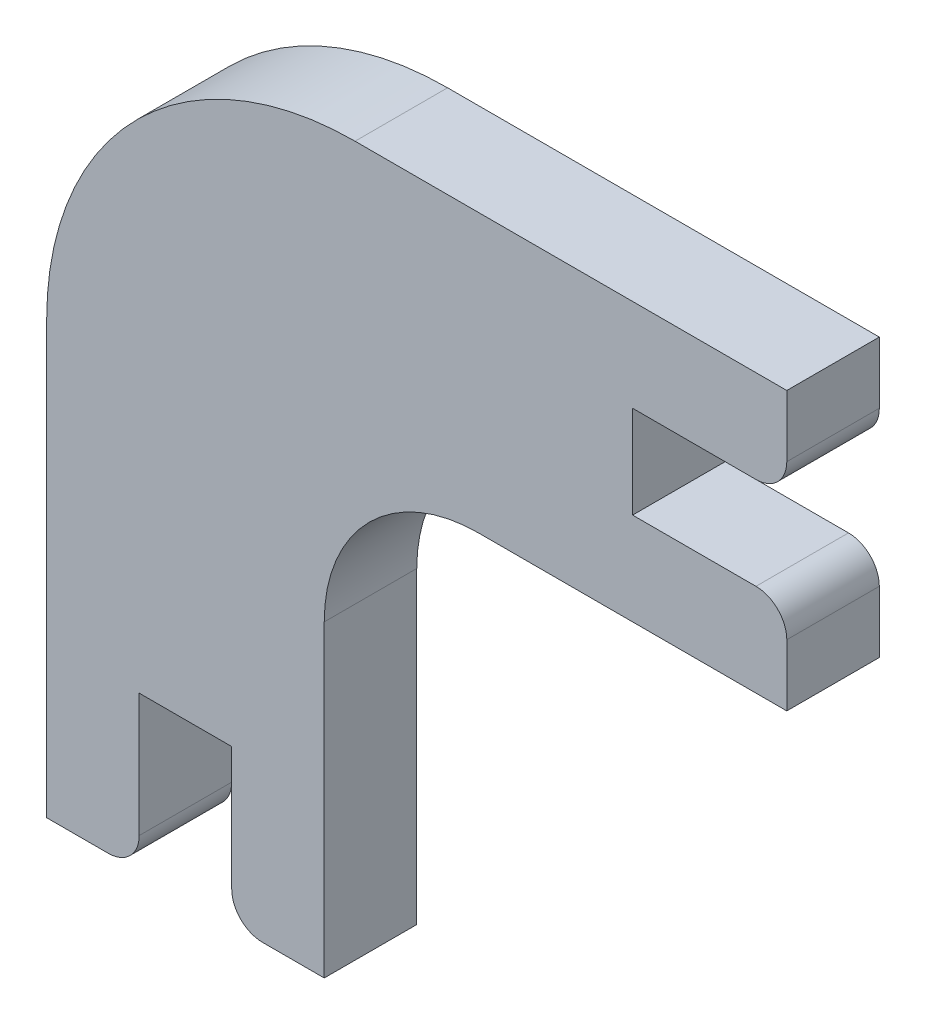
from build123d import *

# Parameters (mm, degrees)
SALIENTE_EXTRUIR1_DEPTH = 3
REDONDEO1_R             = 20
REDONDEO2_R             = 10
REDONDEO3_R             = 2


with BuildPart() as part:
    # Croquis1 → Saliente-Extruir1 (new, symmetric)
    with BuildSketch(Plane.XY):
        Polygon((0, 0), (-30, 0), (-30, -30), (-36, -30), (-36, -20), (-42, -20), (-42, -30), (-48, -30), (-48, 18), (0, 18), (0, 12), (-10, 12), (-10, 6), (0, 6), align=None)
    extrude(amount=SALIENTE_EXTRUIR1_DEPTH, both=True)

    # Redondeo1
    redondeo1_edges = [part.edges().sort_by_distance(p)[0] for p in [
        (-48, 18, 0),
    ]]
    fillet(redondeo1_edges, radius=REDONDEO1_R)

    # Redondeo2
    redondeo2_edges = [part.edges().sort_by_distance(p)[0] for p in [
        (-30, 0, 0),
    ]]
    fillet(redondeo2_edges, radius=REDONDEO2_R)

    # Redondeo3
    redondeo3_edges = [part.edges().sort_by_distance(p)[0] for p in [
        (0, 12, 0),
        (0, 6, 0),
        (-36, -30, 0),
        (-42, -30, 0),
    ]]
    fillet(redondeo3_edges, radius=REDONDEO3_R)


solid = part.part
